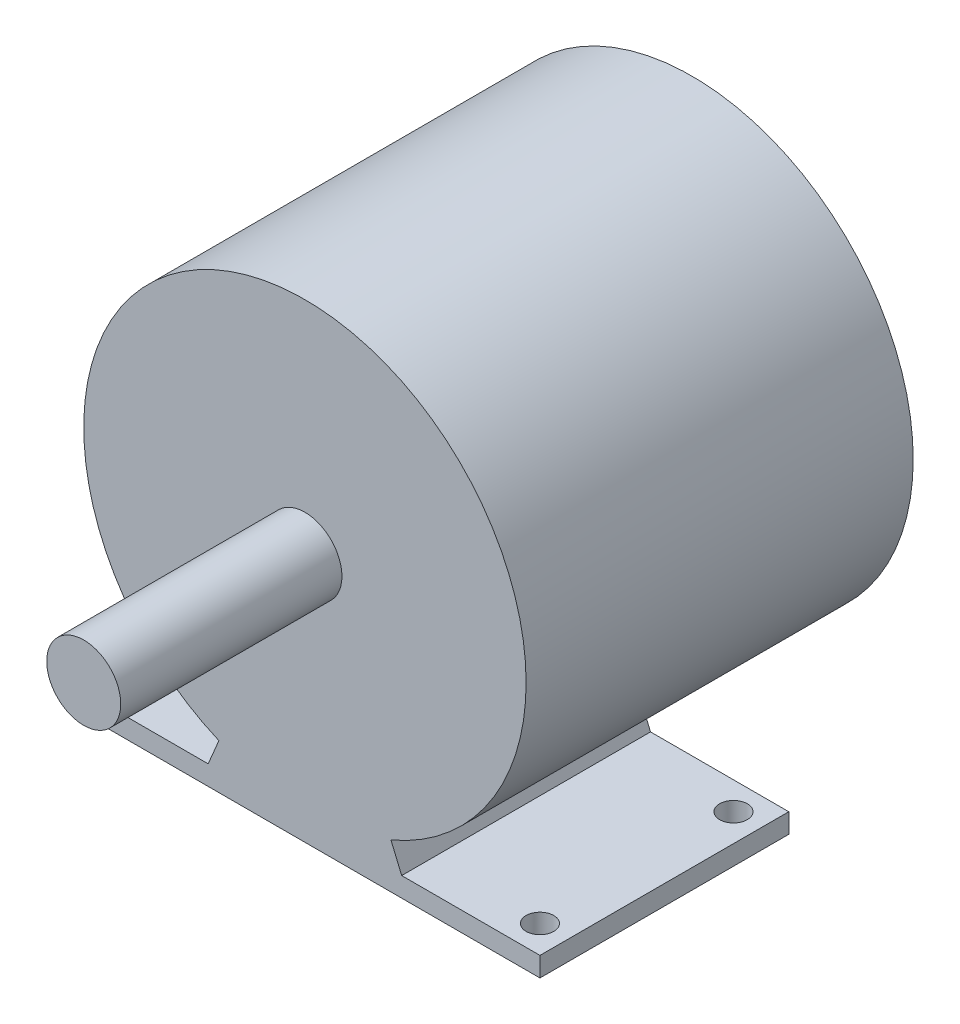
ISO-10303-21;
HEADER;
FILE_DESCRIPTION(('STEP AP214'),'2;1');
FILE_NAME('part.step','',(''),(''),'','','');
FILE_SCHEMA(('AUTOMOTIVE_DESIGN { 1 0 10303 214 1 1 1 1 }'));
ENDSEC;
DATA;
#1=APPLICATION_CONTEXT('core data for automotive mechanical design processes');
#2=APPLICATION_PROTOCOL_DEFINITION('international standard','automotive_design',2000,#1);
#3=PRODUCT_CONTEXT('',#1,'mechanical');
#4=PRODUCT('Part','Part','',(#3));
#5=PRODUCT_RELATED_PRODUCT_CATEGORY('part','',(#4));
#6=PRODUCT_DEFINITION_FORMATION('','',#4);
#7=PRODUCT_DEFINITION_CONTEXT('part definition',#1,'design');
#8=PRODUCT_DEFINITION('design','',#6,#7);
#9=PRODUCT_DEFINITION_SHAPE('','',#8);
#10=(LENGTH_UNIT() NAMED_UNIT(*) SI_UNIT(.MILLI.,.METRE.));
#11=(NAMED_UNIT(*) PLANE_ANGLE_UNIT() SI_UNIT($,.RADIAN.));
#12=(NAMED_UNIT(*) SI_UNIT($,.STERADIAN.) SOLID_ANGLE_UNIT());
#13=UNCERTAINTY_MEASURE_WITH_UNIT(LENGTH_MEASURE(1.E-05),#10,'distance_accuracy_value','');
#14=(GEOMETRIC_REPRESENTATION_CONTEXT(3) GLOBAL_UNCERTAINTY_ASSIGNED_CONTEXT((#13)) GLOBAL_UNIT_ASSIGNED_CONTEXT((#10,
#11,#12)) REPRESENTATION_CONTEXT('',''));
#15=CARTESIAN_POINT('',(0.,0.,0.));
#16=DIRECTION('',(0.,0.,1.));
#17=DIRECTION('',(1.,0.,0.));
#18=AXIS2_PLACEMENT_3D('',#15,#16,#17);
#19=CARTESIAN_POINT('',(0.,0.,-44.45));
#20=DIRECTION('',(0.,0.,1.));
#21=DIRECTION('',(1.,0.,0.));
#22=AXIS2_PLACEMENT_3D('',#19,#20,#21);
#23=CYLINDRICAL_SURFACE('',#22,50.8);
#24=DIRECTION('',(0.,0.,1.));
#25=VECTOR('',#24,1.);
#26=CARTESIAN_POINT('',(19.7555555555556,-46.8012609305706,-12.7));
#27=LINE('',#26,#25);
#28=CARTESIAN_POINT('',(19.7555555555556,-46.8012609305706,-12.7));
#29=VERTEX_POINT('',#28);
#30=CARTESIAN_POINT('',(19.7555555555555,-46.8012609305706,44.45));
#31=VERTEX_POINT('',#30);
#32=EDGE_CURVE('E151',#29,#31,#27,.T.);
#33=ORIENTED_EDGE('',*,*,#32,.F.);
#34=CARTESIAN_POINT('',(0.,0.,-12.7));
#35=DIRECTION('',(0.,0.,-1.));
#36=DIRECTION('',(1.,0.,0.));
#37=AXIS2_PLACEMENT_3D('',#34,#35,#36);
#38=CIRCLE('',#37,50.8000000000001);
#39=CARTESIAN_POINT('',(-19.7555555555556,-46.8012609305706,-12.7));
#40=VERTEX_POINT('',#39);
#41=EDGE_CURVE('E58',#29,#40,#38,.T.);
#42=ORIENTED_EDGE('',*,*,#41,.T.);
#43=DIRECTION('',(0.,0.,1.));
#44=VECTOR('',#43,1.);
#45=CARTESIAN_POINT('',(-19.7555555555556,-46.8012609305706,-12.7));
#46=LINE('',#45,#44);
#47=CARTESIAN_POINT('',(-19.7555555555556,-46.8012609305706,44.45));
#48=VERTEX_POINT('',#47);
#49=EDGE_CURVE('E95',#40,#48,#46,.T.);
#50=ORIENTED_EDGE('',*,*,#49,.T.);
#51=CARTESIAN_POINT('',(0.,0.,44.45));
#52=DIRECTION('',(0.,0.,1.));
#53=DIRECTION('',(1.,0.,0.));
#54=AXIS2_PLACEMENT_3D('',#51,#52,#53);
#55=CIRCLE('',#54,50.8);
#56=EDGE_CURVE('E42',#31,#48,#55,.T.);
#57=ORIENTED_EDGE('',*,*,#56,.F.);
#58=EDGE_LOOP('',(#33,#42,#50,#57));
#59=FACE_BOUND('',#58,.T.);
#60=CARTESIAN_POINT('',(0.,0.,-44.45));
#61=DIRECTION('',(0.,0.,1.));
#62=DIRECTION('',(1.,0.,0.));
#63=AXIS2_PLACEMENT_3D('',#60,#61,#62);
#64=CIRCLE('',#63,50.8);
#65=CARTESIAN_POINT('',(50.8,0.,-44.45));
#66=VERTEX_POINT('',#65);
#67=EDGE_CURVE('E11',#66,#66,#64,.T.);
#68=ORIENTED_EDGE('',*,*,#67,.T.);
#69=EDGE_LOOP('',(#68));
#70=FACE_BOUND('',#69,.T.);
#71=ADVANCED_FACE('F35',(#59,#70),#23,.T.);
#72=CARTESIAN_POINT('',(0.,0.,-44.45));
#73=DIRECTION('',(0.,0.,1.));
#74=DIRECTION('',(1.,0.,0.));
#75=AXIS2_PLACEMENT_3D('',#72,#73,#74);
#76=PLANE('',#75);
#77=ORIENTED_EDGE('',*,*,#67,.F.);
#78=EDGE_LOOP('',(#77));
#79=FACE_BOUND('',#78,.T.);
#80=ADVANCED_FACE('F203',(#79),#76,.F.);
#81=CARTESIAN_POINT('',(0.,0.,44.45));
#82=DIRECTION('',(0.,0.,1.));
#83=DIRECTION('',(1.,0.,0.));
#84=AXIS2_PLACEMENT_3D('',#81,#82,#83);
#85=PLANE('',#84);
#86=CARTESIAN_POINT('',(0.,0.,44.45));
#87=DIRECTION('',(0.,0.,1.));
#88=DIRECTION('',(1.,0.,0.));
#89=AXIS2_PLACEMENT_3D('',#86,#87,#88);
#90=CIRCLE('',#89,8.4999957);
#91=CARTESIAN_POINT('',(8.4999957,0.,44.45));
#92=VERTEX_POINT('',#91);
#93=EDGE_CURVE('E153',#92,#92,#90,.T.);
#94=ORIENTED_EDGE('',*,*,#93,.F.);
#95=EDGE_LOOP('',(#94));
#96=FACE_BOUND('',#95,.T.);
#97=ORIENTED_EDGE('',*,*,#56,.T.);
#98=DIRECTION('',(-0.388888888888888,-0.921284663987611,0.));
#99=VECTOR('',#98,1.);
#100=CARTESIAN_POINT('',(-19.7555555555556,-46.8012609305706,44.45));
#101=LINE('',#100,#99);
#102=CARTESIAN_POINT('',(-22.225,-52.651418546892,44.45));
#103=VERTEX_POINT('',#102);
#104=EDGE_CURVE('E134',#48,#103,#101,.T.);
#105=ORIENTED_EDGE('',*,*,#104,.T.);
#106=DIRECTION('',(-1.,0.,0.));
#107=VECTOR('',#106,1.);
#108=CARTESIAN_POINT('',(-22.225,-52.651418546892,44.45));
#109=LINE('',#108,#107);
#110=CARTESIAN_POINT('',(-53.975,-52.651418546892,44.45));
#111=VERTEX_POINT('',#110);
#112=EDGE_CURVE('E137',#103,#111,#109,.T.);
#113=ORIENTED_EDGE('',*,*,#112,.T.);
#114=DIRECTION('',(0.,-1.,0.));
#115=VECTOR('',#114,1.);
#116=CARTESIAN_POINT('',(-53.975,-52.651418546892,44.45));
#117=LINE('',#116,#115);
#118=CARTESIAN_POINT('',(-53.975,-57.15,44.45));
#119=VERTEX_POINT('',#118);
#120=EDGE_CURVE('E141',#111,#119,#117,.T.);
#121=ORIENTED_EDGE('',*,*,#120,.T.);
#122=DIRECTION('',(1.,0.,0.));
#123=VECTOR('',#122,1.);
#124=CARTESIAN_POINT('',(-53.975,-57.15,44.45));
#125=LINE('',#124,#123);
#126=CARTESIAN_POINT('',(53.975,-57.15,44.45));
#127=VERTEX_POINT('',#126);
#128=EDGE_CURVE('E144',#119,#127,#125,.T.);
#129=ORIENTED_EDGE('',*,*,#128,.T.);
#130=DIRECTION('',(0.,1.,0.));
#131=VECTOR('',#130,1.);
#132=CARTESIAN_POINT('',(53.975,-57.15,44.45));
#133=LINE('',#132,#131);
#134=CARTESIAN_POINT('',(53.975,-52.651418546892,44.45));
#135=VERTEX_POINT('',#134);
#136=EDGE_CURVE('E147',#127,#135,#133,.T.);
#137=ORIENTED_EDGE('',*,*,#136,.T.);
#138=DIRECTION('',(-1.,0.,0.));
#139=VECTOR('',#138,1.);
#140=CARTESIAN_POINT('',(53.975,-52.651418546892,44.45));
#141=LINE('',#140,#139);
#142=CARTESIAN_POINT('',(22.225,-52.651418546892,44.45));
#143=VERTEX_POINT('',#142);
#144=EDGE_CURVE('E112',#135,#143,#141,.T.);
#145=ORIENTED_EDGE('',*,*,#144,.T.);
#146=DIRECTION('',(-0.388888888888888,0.921284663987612,0.));
#147=VECTOR('',#146,1.);
#148=CARTESIAN_POINT('',(22.225,-52.651418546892,44.45));
#149=LINE('',#148,#147);
#150=EDGE_CURVE('E49',#143,#31,#149,.T.);
#151=ORIENTED_EDGE('',*,*,#150,.T.);
#152=EDGE_LOOP('',(#97,#105,#113,#121,#129,#137,#145,#151));
#153=FACE_BOUND('',#152,.T.);
#154=ADVANCED_FACE('F168',(#96,#153),#85,.T.);
#155=CARTESIAN_POINT('',(0.,0.,95.25));
#156=DIRECTION('',(0.,0.,-1.));
#157=DIRECTION('',(-1.,0.,0.));
#158=AXIS2_PLACEMENT_3D('',#155,#156,#157);
#159=CYLINDRICAL_SURFACE('',#158,8.4999957);
#160=CARTESIAN_POINT('',(0.,0.,95.25));
#161=DIRECTION('',(0.,0.,1.));
#162=DIRECTION('',(1.,0.,0.));
#163=AXIS2_PLACEMENT_3D('',#160,#161,#162);
#164=CIRCLE('',#163,8.4999957);
#165=CARTESIAN_POINT('',(8.4999957,0.,95.25));
#166=VERTEX_POINT('',#165);
#167=EDGE_CURVE('E163',#166,#166,#164,.T.);
#168=ORIENTED_EDGE('',*,*,#167,.F.);
#169=EDGE_LOOP('',(#168));
#170=FACE_BOUND('',#169,.T.);
#171=ORIENTED_EDGE('',*,*,#93,.T.);
#172=EDGE_LOOP('',(#171));
#173=FACE_BOUND('',#172,.T.);
#174=ADVANCED_FACE('F214',(#170,#173),#159,.T.);
#175=CARTESIAN_POINT('',(0.,0.,95.25));
#176=DIRECTION('',(0.,0.,1.));
#177=DIRECTION('',(1.,0.,0.));
#178=AXIS2_PLACEMENT_3D('',#175,#176,#177);
#179=PLANE('',#178);
#180=ORIENTED_EDGE('',*,*,#167,.T.);
#181=EDGE_LOOP('',(#180));
#182=FACE_BOUND('',#181,.T.);
#183=ADVANCED_FACE('F219',(#182),#179,.T.);
#184=CARTESIAN_POINT('',(22.225,-52.651418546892,-12.7));
#185=DIRECTION('',(0.921284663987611,0.388888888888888,0.));
#186=DIRECTION('',(-0.388888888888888,0.921284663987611,0.));
#187=AXIS2_PLACEMENT_3D('',#184,#185,#186);
#188=PLANE('',#187);
#189=ORIENTED_EDGE('',*,*,#150,.F.);
#190=DIRECTION('',(0.,0.,1.));
#191=VECTOR('',#190,1.);
#192=CARTESIAN_POINT('',(22.225,-52.651418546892,-12.7));
#193=LINE('',#192,#191);
#194=CARTESIAN_POINT('',(22.225,-52.651418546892,-12.7));
#195=VERTEX_POINT('',#194);
#196=EDGE_CURVE('E88',#195,#143,#193,.T.);
#197=ORIENTED_EDGE('',*,*,#196,.F.);
#198=DIRECTION('',(-0.388888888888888,0.921284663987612,0.));
#199=VECTOR('',#198,1.);
#200=CARTESIAN_POINT('',(22.225,-52.651418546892,-12.7));
#201=LINE('',#200,#199);
#202=EDGE_CURVE('E124',#195,#29,#201,.T.);
#203=ORIENTED_EDGE('',*,*,#202,.T.);
#204=ORIENTED_EDGE('',*,*,#32,.T.);
#205=EDGE_LOOP('',(#189,#197,#203,#204));
#206=FACE_BOUND('',#205,.T.);
#207=ADVANCED_FACE('F222',(#206),#188,.T.);
#208=CARTESIAN_POINT('',(53.975,-52.651418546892,-12.7));
#209=DIRECTION('',(0.,1.,0.));
#210=DIRECTION('',(-1.,0.,0.));
#211=AXIS2_PLACEMENT_3D('',#208,#209,#210);
#212=PLANE('',#211);
#213=CARTESIAN_POINT('',(47.625,-52.651418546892,-6.35));
#214=DIRECTION('',(0.,1.,0.));
#215=DIRECTION('',(-1.,0.,0.));
#216=AXIS2_PLACEMENT_3D('',#213,#214,#215);
#217=CIRCLE('',#216,3.175);
#218=CARTESIAN_POINT('',(44.45,-52.651418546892,-6.35));
#219=VERTEX_POINT('',#218);
#220=EDGE_CURVE('E320',#219,#219,#217,.T.);
#221=ORIENTED_EDGE('',*,*,#220,.F.);
#222=EDGE_LOOP('',(#221));
#223=FACE_BOUND('',#222,.T.);
#224=CARTESIAN_POINT('',(47.625,-52.651418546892,38.1));
#225=DIRECTION('',(0.,1.,0.));
#226=DIRECTION('',(-1.,0.,0.));
#227=AXIS2_PLACEMENT_3D('',#224,#225,#226);
#228=CIRCLE('',#227,3.175);
#229=CARTESIAN_POINT('',(44.45,-52.651418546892,38.1));
#230=VERTEX_POINT('',#229);
#231=EDGE_CURVE('E138',#230,#230,#228,.T.);
#232=ORIENTED_EDGE('',*,*,#231,.F.);
#233=EDGE_LOOP('',(#232));
#234=FACE_BOUND('',#233,.T.);
#235=ORIENTED_EDGE('',*,*,#144,.F.);
#236=DIRECTION('',(0.,0.,1.));
#237=VECTOR('',#236,1.);
#238=CARTESIAN_POINT('',(53.975,-52.651418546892,-12.7));
#239=LINE('',#238,#237);
#240=CARTESIAN_POINT('',(53.975,-52.651418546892,-12.7));
#241=VERTEX_POINT('',#240);
#242=EDGE_CURVE('E108',#241,#135,#239,.T.);
#243=ORIENTED_EDGE('',*,*,#242,.F.);
#244=DIRECTION('',(-1.,0.,0.));
#245=VECTOR('',#244,1.);
#246=CARTESIAN_POINT('',(53.975,-52.651418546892,-12.7));
#247=LINE('',#246,#245);
#248=EDGE_CURVE('E111',#241,#195,#247,.T.);
#249=ORIENTED_EDGE('',*,*,#248,.T.);
#250=ORIENTED_EDGE('',*,*,#196,.T.);
#251=EDGE_LOOP('',(#235,#243,#249,#250));
#252=FACE_BOUND('',#251,.T.);
#253=ADVANCED_FACE('F110',(#223,#234,#252),#212,.T.);
#254=CARTESIAN_POINT('',(53.975,-57.15,-12.7));
#255=DIRECTION('',(1.,0.,0.));
#256=DIRECTION('',(0.,0.,-1.));
#257=AXIS2_PLACEMENT_3D('',#254,#255,#256);
#258=PLANE('',#257);
#259=ORIENTED_EDGE('',*,*,#136,.F.);
#260=DIRECTION('',(0.,0.,1.));
#261=VECTOR('',#260,1.);
#262=CARTESIAN_POINT('',(53.975,-57.15,-12.7));
#263=LINE('',#262,#261);
#264=CARTESIAN_POINT('',(53.975,-57.15,-12.7));
#265=VERTEX_POINT('',#264);
#266=EDGE_CURVE('E117',#265,#127,#263,.T.);
#267=ORIENTED_EDGE('',*,*,#266,.F.);
#268=DIRECTION('',(0.,1.,0.));
#269=VECTOR('',#268,1.);
#270=CARTESIAN_POINT('',(53.975,-57.15,-12.7));
#271=LINE('',#270,#269);
#272=EDGE_CURVE('E122',#265,#241,#271,.T.);
#273=ORIENTED_EDGE('',*,*,#272,.T.);
#274=ORIENTED_EDGE('',*,*,#242,.T.);
#275=EDGE_LOOP('',(#259,#267,#273,#274));
#276=FACE_BOUND('',#275,.T.);
#277=ADVANCED_FACE('F126',(#276),#258,.T.);
#278=CARTESIAN_POINT('',(-53.975,-57.15,-12.7));
#279=DIRECTION('',(0.,-1.,0.));
#280=DIRECTION('',(0.,0.,-1.));
#281=AXIS2_PLACEMENT_3D('',#278,#279,#280);
#282=PLANE('',#281);
#283=CARTESIAN_POINT('',(-47.625,-57.15,38.1));
#284=DIRECTION('',(0.,-1.,0.));
#285=DIRECTION('',(0.,0.,-1.));
#286=AXIS2_PLACEMENT_3D('',#283,#284,#285);
#287=CIRCLE('',#286,3.175);
#288=CARTESIAN_POINT('',(-47.625,-57.15,34.925));
#289=VERTEX_POINT('',#288);
#290=EDGE_CURVE('E304',#289,#289,#287,.T.);
#291=ORIENTED_EDGE('',*,*,#290,.F.);
#292=EDGE_LOOP('',(#291));
#293=FACE_BOUND('',#292,.T.);
#294=CARTESIAN_POINT('',(-47.625,-57.15,-6.35));
#295=DIRECTION('',(0.,-1.,0.));
#296=DIRECTION('',(0.,0.,-1.));
#297=AXIS2_PLACEMENT_3D('',#294,#295,#296);
#298=CIRCLE('',#297,3.175);
#299=CARTESIAN_POINT('',(-47.625,-57.15,-9.525));
#300=VERTEX_POINT('',#299);
#301=EDGE_CURVE('E308',#300,#300,#298,.T.);
#302=ORIENTED_EDGE('',*,*,#301,.F.);
#303=EDGE_LOOP('',(#302));
#304=FACE_BOUND('',#303,.T.);
#305=CARTESIAN_POINT('',(47.625,-57.15,-6.35));
#306=DIRECTION('',(0.,-1.,0.));
#307=DIRECTION('',(0.,0.,-1.));
#308=AXIS2_PLACEMENT_3D('',#305,#306,#307);
#309=CIRCLE('',#308,3.175);
#310=CARTESIAN_POINT('',(47.625,-57.15,-9.525));
#311=VERTEX_POINT('',#310);
#312=EDGE_CURVE('E317',#311,#311,#309,.T.);
#313=ORIENTED_EDGE('',*,*,#312,.F.);
#314=EDGE_LOOP('',(#313));
#315=FACE_BOUND('',#314,.T.);
#316=CARTESIAN_POINT('',(47.625,-57.15,38.1));
#317=DIRECTION('',(0.,-1.,0.));
#318=DIRECTION('',(0.,0.,-1.));
#319=AXIS2_PLACEMENT_3D('',#316,#317,#318);
#320=CIRCLE('',#319,3.175);
#321=CARTESIAN_POINT('',(47.625,-57.15,34.925));
#322=VERTEX_POINT('',#321);
#323=EDGE_CURVE('E322',#322,#322,#320,.T.);
#324=ORIENTED_EDGE('',*,*,#323,.F.);
#325=EDGE_LOOP('',(#324));
#326=FACE_BOUND('',#325,.T.);
#327=ORIENTED_EDGE('',*,*,#128,.F.);
#328=DIRECTION('',(0.,0.,1.));
#329=VECTOR('',#328,1.);
#330=CARTESIAN_POINT('',(-53.975,-57.15,-12.7));
#331=LINE('',#330,#329);
#332=CARTESIAN_POINT('',(-53.975,-57.15,-12.7));
#333=VERTEX_POINT('',#332);
#334=EDGE_CURVE('E156',#333,#119,#331,.T.);
#335=ORIENTED_EDGE('',*,*,#334,.F.);
#336=DIRECTION('',(1.,0.,0.));
#337=VECTOR('',#336,1.);
#338=CARTESIAN_POINT('',(-53.975,-57.15,-12.7));
#339=LINE('',#338,#337);
#340=EDGE_CURVE('E127',#333,#265,#339,.T.);
#341=ORIENTED_EDGE('',*,*,#340,.T.);
#342=ORIENTED_EDGE('',*,*,#266,.T.);
#343=EDGE_LOOP('',(#327,#335,#341,#342));
#344=FACE_BOUND('',#343,.T.);
#345=ADVANCED_FACE('F240',(#293,#304,#315,#326,#344),#282,.T.);
#346=CARTESIAN_POINT('',(-53.975,-52.651418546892,-12.7));
#347=DIRECTION('',(-1.,0.,0.));
#348=DIRECTION('',(0.,0.,1.));
#349=AXIS2_PLACEMENT_3D('',#346,#347,#348);
#350=PLANE('',#349);
#351=ORIENTED_EDGE('',*,*,#120,.F.);
#352=DIRECTION('',(0.,0.,1.));
#353=VECTOR('',#352,1.);
#354=CARTESIAN_POINT('',(-53.975,-52.651418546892,-12.7));
#355=LINE('',#354,#353);
#356=CARTESIAN_POINT('',(-53.975,-52.651418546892,-12.7));
#357=VERTEX_POINT('',#356);
#358=EDGE_CURVE('E158',#357,#111,#355,.T.);
#359=ORIENTED_EDGE('',*,*,#358,.F.);
#360=DIRECTION('',(0.,-1.,0.));
#361=VECTOR('',#360,1.);
#362=CARTESIAN_POINT('',(-53.975,-52.651418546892,-12.7));
#363=LINE('',#362,#361);
#364=EDGE_CURVE('E129',#357,#333,#363,.T.);
#365=ORIENTED_EDGE('',*,*,#364,.T.);
#366=ORIENTED_EDGE('',*,*,#334,.T.);
#367=EDGE_LOOP('',(#351,#359,#365,#366));
#368=FACE_BOUND('',#367,.T.);
#369=ADVANCED_FACE('F184',(#368),#350,.T.);
#370=CARTESIAN_POINT('',(-22.225,-52.651418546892,-12.7));
#371=DIRECTION('',(0.,1.,0.));
#372=DIRECTION('',(0.,0.,1.));
#373=AXIS2_PLACEMENT_3D('',#370,#371,#372);
#374=PLANE('',#373);
#375=CARTESIAN_POINT('',(-47.625,-52.651418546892,38.1));
#376=DIRECTION('',(0.,1.,0.));
#377=DIRECTION('',(0.,0.,1.));
#378=AXIS2_PLACEMENT_3D('',#375,#376,#377);
#379=CIRCLE('',#378,3.175);
#380=CARTESIAN_POINT('',(-47.625,-52.651418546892,41.275));
#381=VERTEX_POINT('',#380);
#382=EDGE_CURVE('E307',#381,#381,#379,.T.);
#383=ORIENTED_EDGE('',*,*,#382,.F.);
#384=EDGE_LOOP('',(#383));
#385=FACE_BOUND('',#384,.T.);
#386=CARTESIAN_POINT('',(-47.625,-52.651418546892,-6.35));
#387=DIRECTION('',(0.,1.,0.));
#388=DIRECTION('',(0.,0.,1.));
#389=AXIS2_PLACEMENT_3D('',#386,#387,#388);
#390=CIRCLE('',#389,3.175);
#391=CARTESIAN_POINT('',(-47.625,-52.651418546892,-3.17500000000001));
#392=VERTEX_POINT('',#391);
#393=EDGE_CURVE('E311',#392,#392,#390,.T.);
#394=ORIENTED_EDGE('',*,*,#393,.F.);
#395=EDGE_LOOP('',(#394));
#396=FACE_BOUND('',#395,.T.);
#397=ORIENTED_EDGE('',*,*,#112,.F.);
#398=DIRECTION('',(0.,0.,1.));
#399=VECTOR('',#398,1.);
#400=CARTESIAN_POINT('',(-22.225,-52.651418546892,-12.7));
#401=LINE('',#400,#399);
#402=CARTESIAN_POINT('',(-22.225,-52.651418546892,-12.7));
#403=VERTEX_POINT('',#402);
#404=EDGE_CURVE('E160',#403,#103,#401,.T.);
#405=ORIENTED_EDGE('',*,*,#404,.F.);
#406=DIRECTION('',(-1.,0.,0.));
#407=VECTOR('',#406,1.);
#408=CARTESIAN_POINT('',(-22.225,-52.651418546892,-12.7));
#409=LINE('',#408,#407);
#410=EDGE_CURVE('E174',#403,#357,#409,.T.);
#411=ORIENTED_EDGE('',*,*,#410,.T.);
#412=ORIENTED_EDGE('',*,*,#358,.T.);
#413=EDGE_LOOP('',(#397,#405,#411,#412));
#414=FACE_BOUND('',#413,.T.);
#415=ADVANCED_FACE('F189',(#385,#396,#414),#374,.T.);
#416=CARTESIAN_POINT('',(-19.7555555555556,-46.8012609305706,-12.7));
#417=DIRECTION('',(-0.921284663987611,0.388888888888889,0.));
#418=DIRECTION('',(-0.388888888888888,-0.921284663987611,0.));
#419=AXIS2_PLACEMENT_3D('',#416,#417,#418);
#420=PLANE('',#419);
#421=ORIENTED_EDGE('',*,*,#104,.F.);
#422=ORIENTED_EDGE('',*,*,#49,.F.);
#423=DIRECTION('',(-0.388888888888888,-0.921284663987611,0.));
#424=VECTOR('',#423,1.);
#425=CARTESIAN_POINT('',(-19.7555555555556,-46.8012609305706,-12.7));
#426=LINE('',#425,#424);
#427=EDGE_CURVE('E172',#40,#403,#426,.T.);
#428=ORIENTED_EDGE('',*,*,#427,.T.);
#429=ORIENTED_EDGE('',*,*,#404,.T.);
#430=EDGE_LOOP('',(#421,#422,#428,#429));
#431=FACE_BOUND('',#430,.T.);
#432=ADVANCED_FACE('F190',(#431),#420,.T.);
#433=CARTESIAN_POINT('',(0.,0.,-12.7));
#434=DIRECTION('',(0.,0.,1.));
#435=DIRECTION('',(1.,0.,0.));
#436=AXIS2_PLACEMENT_3D('',#433,#434,#435);
#437=PLANE('',#436);
#438=ORIENTED_EDGE('',*,*,#41,.F.);
#439=ORIENTED_EDGE('',*,*,#202,.F.);
#440=ORIENTED_EDGE('',*,*,#248,.F.);
#441=ORIENTED_EDGE('',*,*,#272,.F.);
#442=ORIENTED_EDGE('',*,*,#340,.F.);
#443=ORIENTED_EDGE('',*,*,#364,.F.);
#444=ORIENTED_EDGE('',*,*,#410,.F.);
#445=ORIENTED_EDGE('',*,*,#427,.F.);
#446=EDGE_LOOP('',(#438,#439,#440,#441,#442,#443,#444,#445));
#447=FACE_BOUND('',#446,.T.);
#448=ADVANCED_FACE('F120',(#447),#437,.F.);
#449=CARTESIAN_POINT('',(47.625,-57.15,38.1));
#450=DIRECTION('',(0.,-1.,0.));
#451=DIRECTION('',(0.,0.,-1.));
#452=AXIS2_PLACEMENT_3D('',#449,#450,#451);
#453=CYLINDRICAL_SURFACE('',#452,3.175);
#454=ORIENTED_EDGE('',*,*,#323,.T.);
#455=EDGE_LOOP('',(#454));
#456=FACE_BOUND('',#455,.T.);
#457=ORIENTED_EDGE('',*,*,#231,.T.);
#458=EDGE_LOOP('',(#457));
#459=FACE_BOUND('',#458,.T.);
#460=ADVANCED_FACE('F197',(#456,#459),#453,.F.);
#461=CARTESIAN_POINT('',(47.625,-57.15,-6.35));
#462=DIRECTION('',(0.,-1.,0.));
#463=DIRECTION('',(0.,0.,-1.));
#464=AXIS2_PLACEMENT_3D('',#461,#462,#463);
#465=CYLINDRICAL_SURFACE('',#464,3.175);
#466=ORIENTED_EDGE('',*,*,#312,.T.);
#467=EDGE_LOOP('',(#466));
#468=FACE_BOUND('',#467,.T.);
#469=ORIENTED_EDGE('',*,*,#220,.T.);
#470=EDGE_LOOP('',(#469));
#471=FACE_BOUND('',#470,.T.);
#472=ADVANCED_FACE('F267',(#468,#471),#465,.F.);
#473=CARTESIAN_POINT('',(-47.625,-57.15,-6.35));
#474=DIRECTION('',(0.,-1.,0.));
#475=DIRECTION('',(0.,0.,-1.));
#476=AXIS2_PLACEMENT_3D('',#473,#474,#475);
#477=CYLINDRICAL_SURFACE('',#476,3.175);
#478=ORIENTED_EDGE('',*,*,#301,.T.);
#479=EDGE_LOOP('',(#478));
#480=FACE_BOUND('',#479,.T.);
#481=ORIENTED_EDGE('',*,*,#393,.T.);
#482=EDGE_LOOP('',(#481));
#483=FACE_BOUND('',#482,.T.);
#484=ADVANCED_FACE('F277',(#480,#483),#477,.F.);
#485=CARTESIAN_POINT('',(-47.625,-57.15,38.1));
#486=DIRECTION('',(0.,-1.,0.));
#487=DIRECTION('',(0.,0.,-1.));
#488=AXIS2_PLACEMENT_3D('',#485,#486,#487);
#489=CYLINDRICAL_SURFACE('',#488,3.175);
#490=ORIENTED_EDGE('',*,*,#290,.T.);
#491=EDGE_LOOP('',(#490));
#492=FACE_BOUND('',#491,.T.);
#493=ORIENTED_EDGE('',*,*,#382,.T.);
#494=EDGE_LOOP('',(#493));
#495=FACE_BOUND('',#494,.T.);
#496=ADVANCED_FACE('F287',(#492,#495),#489,.F.);
#497=CLOSED_SHELL('',(#71,#80,#154,#174,#183,#207,#253,#277,#345,#369,#415,#432,#448,#460,#472,
#484,#496));
#498=MANIFOLD_SOLID_BREP('B2',#497);
#499=ADVANCED_BREP_SHAPE_REPRESENTATION('',(#18,#498),#14);
#500=SHAPE_DEFINITION_REPRESENTATION(#9,#499);
ENDSEC;
END-ISO-10303-21;
